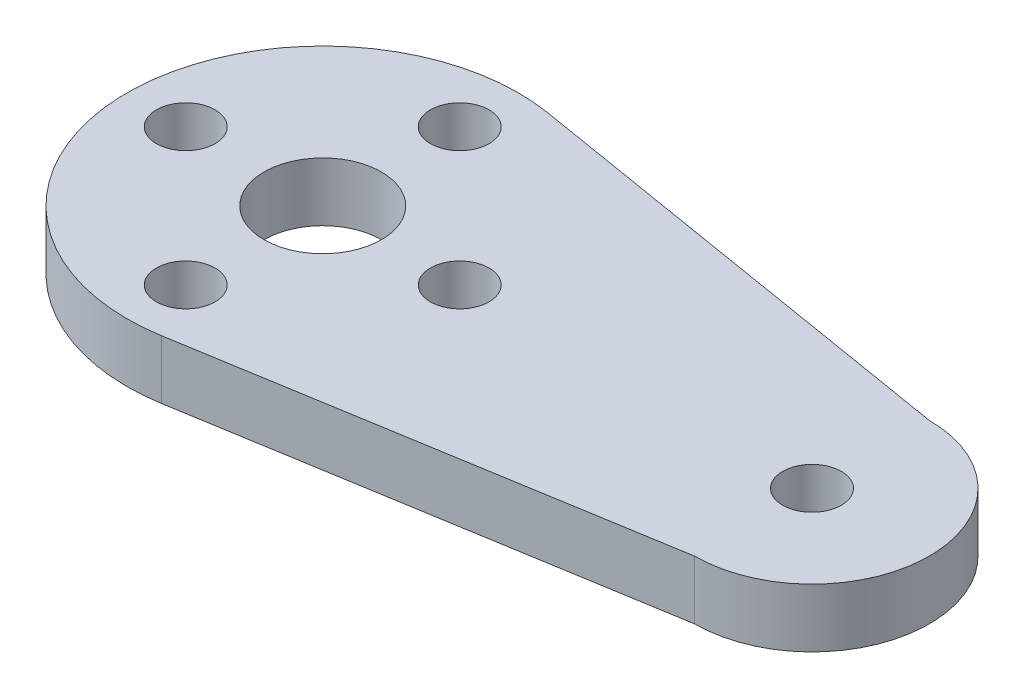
ISO-10303-21;
HEADER;
FILE_DESCRIPTION(('STEP AP214'),'2;1');
FILE_NAME('part.step','',(''),(''),'','','');
FILE_SCHEMA(('AUTOMOTIVE_DESIGN { 1 0 10303 214 1 1 1 1 }'));
ENDSEC;
DATA;
#1=APPLICATION_CONTEXT('core data for automotive mechanical design processes');
#2=APPLICATION_PROTOCOL_DEFINITION('international standard','automotive_design',2000,#1);
#3=PRODUCT_CONTEXT('',#1,'mechanical');
#4=PRODUCT('Part','Part','',(#3));
#5=PRODUCT_RELATED_PRODUCT_CATEGORY('part','',(#4));
#6=PRODUCT_DEFINITION_FORMATION('','',#4);
#7=PRODUCT_DEFINITION_CONTEXT('part definition',#1,'design');
#8=PRODUCT_DEFINITION('design','',#6,#7);
#9=PRODUCT_DEFINITION_SHAPE('','',#8);
#10=(LENGTH_UNIT() NAMED_UNIT(*) SI_UNIT(.MILLI.,.METRE.));
#11=(NAMED_UNIT(*) PLANE_ANGLE_UNIT() SI_UNIT($,.RADIAN.));
#12=(NAMED_UNIT(*) SI_UNIT($,.STERADIAN.) SOLID_ANGLE_UNIT());
#13=UNCERTAINTY_MEASURE_WITH_UNIT(LENGTH_MEASURE(1.E-05),#10,'distance_accuracy_value','');
#14=(GEOMETRIC_REPRESENTATION_CONTEXT(3) GLOBAL_UNCERTAINTY_ASSIGNED_CONTEXT((#13)) GLOBAL_UNIT_ASSIGNED_CONTEXT((#10,
#11,#12)) REPRESENTATION_CONTEXT('',''));
#15=CARTESIAN_POINT('',(0.,0.,0.));
#16=DIRECTION('',(0.,0.,1.));
#17=DIRECTION('',(1.,0.,0.));
#18=AXIS2_PLACEMENT_3D('',#15,#16,#17);
#19=CARTESIAN_POINT('',(1.63218409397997,3.,9.8658996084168));
#20=DIRECTION('',(-0.163218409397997,0.,-0.98658996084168));
#21=DIRECTION('',(-0.98658996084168,0.,0.163218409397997));
#22=AXIS2_PLACEMENT_3D('',#19,#20,#21);
#23=PLANE('',#22);
#24=DIRECTION('',(0.98658996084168,0.,-0.163218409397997));
#25=VECTOR('',#24,1.);
#26=CARTESIAN_POINT('',(1.63218409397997,0.,9.8658996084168));
#27=LINE('',#26,#25);
#28=CARTESIAN_POINT('',(1.63218409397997,0.,9.8658996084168));
#29=VERTEX_POINT('',#28);
#30=CARTESIAN_POINT('',(25.,0.,6.));
#31=VERTEX_POINT('',#30);
#32=EDGE_CURVE('E116',#29,#31,#27,.T.);
#33=ORIENTED_EDGE('',*,*,#32,.T.);
#34=DIRECTION('',(0.,-1.,0.));
#35=VECTOR('',#34,1.);
#36=CARTESIAN_POINT('',(25.,3.,6.));
#37=LINE('',#36,#35);
#38=CARTESIAN_POINT('',(25.,3.,6.));
#39=VERTEX_POINT('',#38);
#40=EDGE_CURVE('E11',#39,#31,#37,.T.);
#41=ORIENTED_EDGE('',*,*,#40,.F.);
#42=DIRECTION('',(0.98658996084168,0.,-0.163218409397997));
#43=VECTOR('',#42,1.);
#44=CARTESIAN_POINT('',(1.63218409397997,3.,9.8658996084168));
#45=LINE('',#44,#43);
#46=CARTESIAN_POINT('',(1.63218409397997,3.,9.8658996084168));
#47=VERTEX_POINT('',#46);
#48=EDGE_CURVE('E83',#47,#39,#45,.T.);
#49=ORIENTED_EDGE('',*,*,#48,.F.);
#50=DIRECTION('',(0.,-1.,0.));
#51=VECTOR('',#50,1.);
#52=CARTESIAN_POINT('',(1.63218409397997,3.,9.8658996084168));
#53=LINE('',#52,#51);
#54=EDGE_CURVE('E115',#47,#29,#53,.T.);
#55=ORIENTED_EDGE('',*,*,#54,.T.);
#56=EDGE_LOOP('',(#33,#41,#49,#55));
#57=FACE_BOUND('',#56,.T.);
#58=ADVANCED_FACE('F35',(#57),#23,.F.);
#59=CARTESIAN_POINT('',(25.,3.,0.));
#60=DIRECTION('',(0.,-1.,0.));
#61=DIRECTION('',(0.,0.,-1.));
#62=AXIS2_PLACEMENT_3D('',#59,#60,#61);
#63=CYLINDRICAL_SURFACE('',#62,6.);
#64=CARTESIAN_POINT('',(25.,0.,0.));
#65=DIRECTION('',(0.,1.,0.));
#66=DIRECTION('',(0.,0.,1.));
#67=AXIS2_PLACEMENT_3D('',#64,#65,#66);
#68=CIRCLE('',#67,6.);
#69=CARTESIAN_POINT('',(25.,0.,-6.));
#70=VERTEX_POINT('',#69);
#71=EDGE_CURVE('E88',#31,#70,#68,.T.);
#72=ORIENTED_EDGE('',*,*,#71,.T.);
#73=DIRECTION('',(0.,-1.,0.));
#74=VECTOR('',#73,1.);
#75=CARTESIAN_POINT('',(25.,3.,-6.));
#76=LINE('',#75,#74);
#77=CARTESIAN_POINT('',(25.,3.,-6.));
#78=VERTEX_POINT('',#77);
#79=EDGE_CURVE('E43',#78,#70,#76,.T.);
#80=ORIENTED_EDGE('',*,*,#79,.F.);
#81=CARTESIAN_POINT('',(25.,3.,0.));
#82=DIRECTION('',(0.,1.,0.));
#83=DIRECTION('',(0.,0.,1.));
#84=AXIS2_PLACEMENT_3D('',#81,#82,#83);
#85=CIRCLE('',#84,6.);
#86=EDGE_CURVE('E77',#39,#78,#85,.T.);
#87=ORIENTED_EDGE('',*,*,#86,.F.);
#88=ORIENTED_EDGE('',*,*,#40,.T.);
#89=EDGE_LOOP('',(#72,#80,#87,#88));
#90=FACE_BOUND('',#89,.T.);
#91=ADVANCED_FACE('F87',(#90),#63,.T.);
#92=CARTESIAN_POINT('',(1.63218409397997,3.,-9.8658996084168));
#93=DIRECTION('',(0.163218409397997,0.,-0.98658996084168));
#94=DIRECTION('',(-0.98658996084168,0.,-0.163218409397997));
#95=AXIS2_PLACEMENT_3D('',#92,#93,#94);
#96=PLANE('',#95);
#97=DIRECTION('',(0.98658996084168,0.,0.163218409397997));
#98=VECTOR('',#97,1.);
#99=CARTESIAN_POINT('',(1.63218409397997,0.,-9.8658996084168));
#100=LINE('',#99,#98);
#101=CARTESIAN_POINT('',(1.63218409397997,0.,-9.8658996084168));
#102=VERTEX_POINT('',#101);
#103=EDGE_CURVE('E120',#102,#70,#100,.T.);
#104=ORIENTED_EDGE('',*,*,#103,.F.);
#105=DIRECTION('',(0.,-1.,0.));
#106=VECTOR('',#105,1.);
#107=CARTESIAN_POINT('',(1.63218409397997,3.,-9.8658996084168));
#108=LINE('',#107,#106);
#109=CARTESIAN_POINT('',(1.63218409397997,3.,-9.8658996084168));
#110=VERTEX_POINT('',#109);
#111=EDGE_CURVE('E67',#110,#102,#108,.T.);
#112=ORIENTED_EDGE('',*,*,#111,.F.);
#113=DIRECTION('',(0.98658996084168,0.,0.163218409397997));
#114=VECTOR('',#113,1.);
#115=CARTESIAN_POINT('',(1.63218409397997,3.,-9.8658996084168));
#116=LINE('',#115,#114);
#117=EDGE_CURVE('E81',#110,#78,#116,.T.);
#118=ORIENTED_EDGE('',*,*,#117,.T.);
#119=ORIENTED_EDGE('',*,*,#79,.T.);
#120=EDGE_LOOP('',(#104,#112,#118,#119));
#121=FACE_BOUND('',#120,.T.);
#122=ADVANCED_FACE('F92',(#121),#96,.T.);
#123=CARTESIAN_POINT('',(0.,3.,-7.));
#124=DIRECTION('',(0.,-1.,0.));
#125=DIRECTION('',(0.,0.,-1.));
#126=AXIS2_PLACEMENT_3D('',#123,#124,#125);
#127=CYLINDRICAL_SURFACE('',#126,1.5);
#128=CARTESIAN_POINT('',(0.,3.,-7.));
#129=DIRECTION('',(0.,1.,0.));
#130=DIRECTION('',(0.,0.,1.));
#131=AXIS2_PLACEMENT_3D('',#128,#129,#130);
#132=CIRCLE('',#131,1.5);
#133=CARTESIAN_POINT('',(0.,3.,-5.5));
#134=VERTEX_POINT('',#133);
#135=EDGE_CURVE('E109',#134,#134,#132,.T.);
#136=ORIENTED_EDGE('',*,*,#135,.T.);
#137=EDGE_LOOP('',(#136));
#138=FACE_BOUND('',#137,.T.);
#139=CARTESIAN_POINT('',(0.,0.,-7.));
#140=DIRECTION('',(0.,1.,0.));
#141=DIRECTION('',(0.,0.,1.));
#142=AXIS2_PLACEMENT_3D('',#139,#140,#141);
#143=CIRCLE('',#142,1.5);
#144=CARTESIAN_POINT('',(0.,0.,-5.5));
#145=VERTEX_POINT('',#144);
#146=EDGE_CURVE('E135',#145,#145,#143,.T.);
#147=ORIENTED_EDGE('',*,*,#146,.F.);
#148=EDGE_LOOP('',(#147));
#149=FACE_BOUND('',#148,.T.);
#150=ADVANCED_FACE('F181',(#138,#149),#127,.F.);
#151=CARTESIAN_POINT('',(0.,3.,0.));
#152=DIRECTION('',(0.,-1.,0.));
#153=DIRECTION('',(0.,0.,-1.));
#154=AXIS2_PLACEMENT_3D('',#151,#152,#153);
#155=CYLINDRICAL_SURFACE('',#154,3.);
#156=CARTESIAN_POINT('',(0.,3.,0.));
#157=DIRECTION('',(0.,1.,0.));
#158=DIRECTION('',(0.,0.,1.));
#159=AXIS2_PLACEMENT_3D('',#156,#157,#158);
#160=CIRCLE('',#159,3.);
#161=CARTESIAN_POINT('',(0.,3.,3.));
#162=VERTEX_POINT('',#161);
#163=EDGE_CURVE('E106',#162,#162,#160,.T.);
#164=ORIENTED_EDGE('',*,*,#163,.T.);
#165=EDGE_LOOP('',(#164));
#166=FACE_BOUND('',#165,.T.);
#167=CARTESIAN_POINT('',(0.,0.,0.));
#168=DIRECTION('',(0.,1.,0.));
#169=DIRECTION('',(0.,0.,1.));
#170=AXIS2_PLACEMENT_3D('',#167,#168,#169);
#171=CIRCLE('',#170,3.);
#172=CARTESIAN_POINT('',(0.,0.,3.));
#173=VERTEX_POINT('',#172);
#174=EDGE_CURVE('E132',#173,#173,#171,.T.);
#175=ORIENTED_EDGE('',*,*,#174,.F.);
#176=EDGE_LOOP('',(#175));
#177=FACE_BOUND('',#176,.T.);
#178=ADVANCED_FACE('F194',(#166,#177),#155,.F.);
#179=CARTESIAN_POINT('',(-6.99999999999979,3.,2.12611729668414E-13));
#180=DIRECTION('',(0.,-1.,0.));
#181=DIRECTION('',(0.,0.,-1.));
#182=AXIS2_PLACEMENT_3D('',#179,#180,#181);
#183=CYLINDRICAL_SURFACE('',#182,1.5);
#184=CARTESIAN_POINT('',(-6.99999999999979,3.,2.12611729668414E-13));
#185=DIRECTION('',(0.,1.,0.));
#186=DIRECTION('',(0.,0.,1.));
#187=AXIS2_PLACEMENT_3D('',#184,#185,#186);
#188=CIRCLE('',#187,1.5);
#189=CARTESIAN_POINT('',(-6.99999999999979,3.,1.50000000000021));
#190=VERTEX_POINT('',#189);
#191=EDGE_CURVE('E103',#190,#190,#188,.T.);
#192=ORIENTED_EDGE('',*,*,#191,.T.);
#193=EDGE_LOOP('',(#192));
#194=FACE_BOUND('',#193,.T.);
#195=CARTESIAN_POINT('',(-6.99999999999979,0.,2.12611729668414E-13));
#196=DIRECTION('',(0.,1.,0.));
#197=DIRECTION('',(0.,0.,1.));
#198=AXIS2_PLACEMENT_3D('',#195,#196,#197);
#199=CIRCLE('',#198,1.5);
#200=CARTESIAN_POINT('',(-6.99999999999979,0.,1.50000000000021));
#201=VERTEX_POINT('',#200);
#202=EDGE_CURVE('E129',#201,#201,#199,.T.);
#203=ORIENTED_EDGE('',*,*,#202,.F.);
#204=EDGE_LOOP('',(#203));
#205=FACE_BOUND('',#204,.T.);
#206=ADVANCED_FACE('F190',(#194,#205),#183,.F.);
#207=CARTESIAN_POINT('',(7.00000000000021,3.,-2.11754476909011E-13));
#208=DIRECTION('',(0.,-1.,0.));
#209=DIRECTION('',(0.,0.,-1.));
#210=AXIS2_PLACEMENT_3D('',#207,#208,#209);
#211=CYLINDRICAL_SURFACE('',#210,1.5);
#212=CARTESIAN_POINT('',(7.00000000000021,3.,-2.11754476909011E-13));
#213=DIRECTION('',(0.,1.,0.));
#214=DIRECTION('',(0.,0.,1.));
#215=AXIS2_PLACEMENT_3D('',#212,#213,#214);
#216=CIRCLE('',#215,1.5);
#217=CARTESIAN_POINT('',(7.00000000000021,3.,1.49999999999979));
#218=VERTEX_POINT('',#217);
#219=EDGE_CURVE('E100',#218,#218,#216,.T.);
#220=ORIENTED_EDGE('',*,*,#219,.T.);
#221=EDGE_LOOP('',(#220));
#222=FACE_BOUND('',#221,.T.);
#223=CARTESIAN_POINT('',(7.00000000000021,0.,-2.11754476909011E-13));
#224=DIRECTION('',(0.,1.,0.));
#225=DIRECTION('',(0.,0.,1.));
#226=AXIS2_PLACEMENT_3D('',#223,#224,#225);
#227=CIRCLE('',#226,1.5);
#228=CARTESIAN_POINT('',(7.00000000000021,0.,1.49999999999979));
#229=VERTEX_POINT('',#228);
#230=EDGE_CURVE('E126',#229,#229,#227,.T.);
#231=ORIENTED_EDGE('',*,*,#230,.F.);
#232=EDGE_LOOP('',(#231));
#233=FACE_BOUND('',#232,.T.);
#234=ADVANCED_FACE('F186',(#222,#233),#211,.F.);
#235=CARTESIAN_POINT('',(25.,3.,0.));
#236=DIRECTION('',(0.,-1.,0.));
#237=DIRECTION('',(0.,0.,-1.));
#238=AXIS2_PLACEMENT_3D('',#235,#236,#237);
#239=CYLINDRICAL_SURFACE('',#238,1.5);
#240=CARTESIAN_POINT('',(25.,3.,0.));
#241=DIRECTION('',(0.,1.,0.));
#242=DIRECTION('',(0.,0.,1.));
#243=AXIS2_PLACEMENT_3D('',#240,#241,#242);
#244=CIRCLE('',#243,1.5);
#245=CARTESIAN_POINT('',(25.,3.,1.5));
#246=VERTEX_POINT('',#245);
#247=EDGE_CURVE('E94',#246,#246,#244,.T.);
#248=ORIENTED_EDGE('',*,*,#247,.T.);
#249=EDGE_LOOP('',(#248));
#250=FACE_BOUND('',#249,.T.);
#251=CARTESIAN_POINT('',(25.,0.,0.));
#252=DIRECTION('',(0.,1.,0.));
#253=DIRECTION('',(0.,0.,1.));
#254=AXIS2_PLACEMENT_3D('',#251,#252,#253);
#255=CIRCLE('',#254,1.5);
#256=CARTESIAN_POINT('',(25.,0.,1.5));
#257=VERTEX_POINT('',#256);
#258=EDGE_CURVE('E123',#257,#257,#255,.T.);
#259=ORIENTED_EDGE('',*,*,#258,.F.);
#260=EDGE_LOOP('',(#259));
#261=FACE_BOUND('',#260,.T.);
#262=ADVANCED_FACE('F171',(#250,#261),#239,.F.);
#263=CARTESIAN_POINT('',(0.,3.,0.));
#264=DIRECTION('',(0.,-1.,0.));
#265=DIRECTION('',(0.,0.,-1.));
#266=AXIS2_PLACEMENT_3D('',#263,#264,#265);
#267=CYLINDRICAL_SURFACE('',#266,10.);
#268=CARTESIAN_POINT('',(0.,0.,0.));
#269=DIRECTION('',(0.,1.,0.));
#270=DIRECTION('',(0.,0.,1.));
#271=AXIS2_PLACEMENT_3D('',#268,#269,#270);
#272=CIRCLE('',#271,10.);
#273=EDGE_CURVE('E70',#102,#29,#272,.T.);
#274=ORIENTED_EDGE('',*,*,#273,.T.);
#275=ORIENTED_EDGE('',*,*,#54,.F.);
#276=CARTESIAN_POINT('',(0.,3.,0.));
#277=DIRECTION('',(0.,1.,0.));
#278=DIRECTION('',(0.,0.,1.));
#279=AXIS2_PLACEMENT_3D('',#276,#277,#278);
#280=CIRCLE('',#279,10.);
#281=EDGE_CURVE('E51',#110,#47,#280,.T.);
#282=ORIENTED_EDGE('',*,*,#281,.F.);
#283=ORIENTED_EDGE('',*,*,#111,.T.);
#284=EDGE_LOOP('',(#274,#275,#282,#283));
#285=FACE_BOUND('',#284,.T.);
#286=ADVANCED_FACE('F163',(#285),#267,.T.);
#287=CARTESIAN_POINT('',(4.23508953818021E-13,3.,7.));
#288=DIRECTION('',(0.,-1.,0.));
#289=DIRECTION('',(0.,0.,-1.));
#290=AXIS2_PLACEMENT_3D('',#287,#288,#289);
#291=CYLINDRICAL_SURFACE('',#290,1.5);
#292=CARTESIAN_POINT('',(4.23508953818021E-13,3.,7.));
#293=DIRECTION('',(0.,1.,0.));
#294=DIRECTION('',(0.,0.,1.));
#295=AXIS2_PLACEMENT_3D('',#292,#293,#294);
#296=CIRCLE('',#295,1.5);
#297=CARTESIAN_POINT('',(4.23508953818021E-13,3.,8.5));
#298=VERTEX_POINT('',#297);
#299=EDGE_CURVE('E112',#298,#298,#296,.T.);
#300=ORIENTED_EDGE('',*,*,#299,.T.);
#301=EDGE_LOOP('',(#300));
#302=FACE_BOUND('',#301,.T.);
#303=CARTESIAN_POINT('',(4.23508953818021E-13,0.,7.));
#304=DIRECTION('',(0.,1.,0.));
#305=DIRECTION('',(0.,0.,1.));
#306=AXIS2_PLACEMENT_3D('',#303,#304,#305);
#307=CIRCLE('',#306,1.5);
#308=CARTESIAN_POINT('',(4.23508953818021E-13,0.,8.5));
#309=VERTEX_POINT('',#308);
#310=EDGE_CURVE('E138',#309,#309,#307,.T.);
#311=ORIENTED_EDGE('',*,*,#310,.F.);
#312=EDGE_LOOP('',(#311));
#313=FACE_BOUND('',#312,.T.);
#314=ADVANCED_FACE('F161',(#302,#313),#291,.F.);
#315=CARTESIAN_POINT('',(0.,3.,0.));
#316=DIRECTION('',(0.,1.,0.));
#317=DIRECTION('',(0.,0.,1.));
#318=AXIS2_PLACEMENT_3D('',#315,#316,#317);
#319=PLANE('',#318);
#320=ORIENTED_EDGE('',*,*,#48,.T.);
#321=ORIENTED_EDGE('',*,*,#86,.T.);
#322=ORIENTED_EDGE('',*,*,#117,.F.);
#323=ORIENTED_EDGE('',*,*,#281,.T.);
#324=EDGE_LOOP('',(#320,#321,#322,#323));
#325=FACE_BOUND('',#324,.T.);
#326=ORIENTED_EDGE('',*,*,#247,.F.);
#327=EDGE_LOOP('',(#326));
#328=FACE_BOUND('',#327,.T.);
#329=ORIENTED_EDGE('',*,*,#219,.F.);
#330=EDGE_LOOP('',(#329));
#331=FACE_BOUND('',#330,.T.);
#332=ORIENTED_EDGE('',*,*,#191,.F.);
#333=EDGE_LOOP('',(#332));
#334=FACE_BOUND('',#333,.T.);
#335=ORIENTED_EDGE('',*,*,#163,.F.);
#336=EDGE_LOOP('',(#335));
#337=FACE_BOUND('',#336,.T.);
#338=ORIENTED_EDGE('',*,*,#135,.F.);
#339=EDGE_LOOP('',(#338));
#340=FACE_BOUND('',#339,.T.);
#341=ORIENTED_EDGE('',*,*,#299,.F.);
#342=EDGE_LOOP('',(#341));
#343=FACE_BOUND('',#342,.T.);
#344=ADVANCED_FACE('F78',(#325,#328,#331,#334,#337,#340,#343),#319,.T.);
#345=CARTESIAN_POINT('',(0.,0.,0.));
#346=DIRECTION('',(0.,1.,0.));
#347=DIRECTION('',(0.,0.,1.));
#348=AXIS2_PLACEMENT_3D('',#345,#346,#347);
#349=PLANE('',#348);
#350=ORIENTED_EDGE('',*,*,#32,.F.);
#351=ORIENTED_EDGE('',*,*,#273,.F.);
#352=ORIENTED_EDGE('',*,*,#103,.T.);
#353=ORIENTED_EDGE('',*,*,#71,.F.);
#354=EDGE_LOOP('',(#350,#351,#352,#353));
#355=FACE_BOUND('',#354,.T.);
#356=ORIENTED_EDGE('',*,*,#258,.T.);
#357=EDGE_LOOP('',(#356));
#358=FACE_BOUND('',#357,.T.);
#359=ORIENTED_EDGE('',*,*,#230,.T.);
#360=EDGE_LOOP('',(#359));
#361=FACE_BOUND('',#360,.T.);
#362=ORIENTED_EDGE('',*,*,#202,.T.);
#363=EDGE_LOOP('',(#362));
#364=FACE_BOUND('',#363,.T.);
#365=ORIENTED_EDGE('',*,*,#174,.T.);
#366=EDGE_LOOP('',(#365));
#367=FACE_BOUND('',#366,.T.);
#368=ORIENTED_EDGE('',*,*,#146,.T.);
#369=EDGE_LOOP('',(#368));
#370=FACE_BOUND('',#369,.T.);
#371=ORIENTED_EDGE('',*,*,#310,.T.);
#372=EDGE_LOOP('',(#371));
#373=FACE_BOUND('',#372,.T.);
#374=ADVANCED_FACE('F145',(#355,#358,#361,#364,#367,#370,#373),#349,.F.);
#375=CLOSED_SHELL('',(#58,#91,#122,#150,#178,#206,#234,#262,#286,#314,#344,#374));
#376=MANIFOLD_SOLID_BREP('B2',#375);
#377=ADVANCED_BREP_SHAPE_REPRESENTATION('',(#18,#376),#14);
#378=SHAPE_DEFINITION_REPRESENTATION(#9,#377);
ENDSEC;
END-ISO-10303-21;
